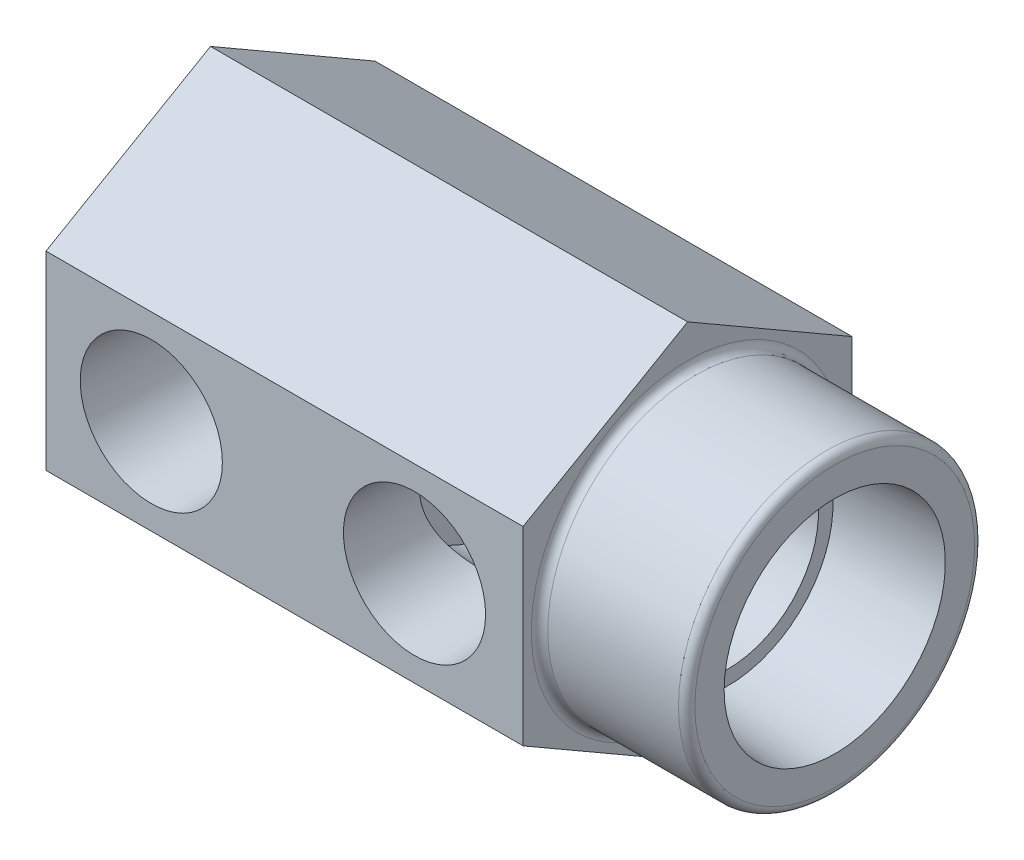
from build123d import *

# Parameters (mm, degrees)
BOSS_EXTRUDE1_DEPTH                  = 46.0375
SKETCH3_R                            = 14.2875
BOSS_EXTRUDE2_DEPTH                  = 14.1986
F_1_4_NPT_TAPPED_HOLE2_AT_2_COUNT    = 2
F_1_4_NPT_TAPPED_HOLE2_AT_2_PITCH    = 25.4
FILLET1_R                            = 0.79375
F_25_64_0_39063_DIAMETER_HOLE1_D     = 9.922002
F_25_64_0_39063_DIAMETER_HOLE1_DEPTH = 50.8
F_25_64_0_39063_DIAMETER_HOLE1_TIP   = 2.980870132
F_7_16_0_4375_DIAMETER_HOLE1_D       = 11.1125
F_7_16_0_4375_DIAMETER_HOLE1_DEPTH   = 45.72
F_7_16_0_4375_DIAMETER_HOLE1_TIP     = 3.338531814


with BuildPart() as part:
    # Sketch2 → Boss-Extrude1 (new body)
    with BuildSketch(Plane(origin=(0, 0, 0), x_dir=(0, 0, -1), z_dir=(1, 0, 0))):
        Polygon((15.875, -9.165435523), (15.875, 9.165435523), (0, 18.330871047), (-15.875, 9.165435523), (-15.875, -9.165435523), (0, -18.330871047), align=None)
    extrude(amount=BOSS_EXTRUDE1_DEPTH)

    # Sketch3 → Boss-Extrude2 (add)
    with BuildSketch(Plane(origin=(46.0375, 0, 0), x_dir=(0, 0, -1), z_dir=(1, 0, 0))):
        with Locations(Location((0, 0, 0), (0, 0, 180))):
            Circle(SKETCH3_R)
    extrude(amount=BOSS_EXTRUDE2_DEPTH)

    # Sketch5 → Cut-Revolve1 (revolve, cut)
    with BuildSketch(Plane(origin=(0, 0, 0), x_dir=(1, 0, 0), z_dir=(0, 1, 0)), mode=Mode.PRIVATE) as cut_revolve1_sk:
        Polygon((49.9364, 8.73125), (27.2161, 8.73125), (27.2161, 0), (60.2361, 0), (60.2361, 10.674384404), (49.9364, 10.1346), align=None)
    revolve(cut_revolve1_sk.sketch.rotate(Axis((-14.001925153, 0, 0), (1, 0, 0)), 180), axis=Axis((-14.001925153, 0, 0), (1, 0, 0)), mode=Mode.SUBTRACT)

    # Sketch6 → 1_4 NPT Tapped Hole1 (revolve, cut)
    with BuildSketch(Plane(origin=(10.16, 0, -15.875), x_dir=(0, 1, 0), z_dir=(1, 0, 0))):
        Polygon((0, 0), (0, 20.411147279), (5.5626, 17.0688), (5.5626, 10.0203), (6.557978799, 10.0203), (6.858, 0), align=None)
    revolve(axis=Axis((10.16, 0, -22.225), (0, 0, 1)), mode=Mode.SUBTRACT)

    # Sketch8 → 1_4 NPT Tapped Hole2 (revolve, cut)
    with BuildSketch(Plane(origin=(10.16, 0, 15.875), x_dir=(0, -1, 0), z_dir=(1, 0, 0))):
        Polygon((0, 0), (0, 16.042347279), (5.5626, 12.7), (5.5626, 10.0203), (6.557978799, 10.0203), (6.858, 0), align=None)
    f_1_4_npt_tapped_hole2 = revolve(axis=Axis((10.16, 0, 22.225), (0, 0, -1)), mode=Mode.SUBTRACT)

    # 1_4 NPT Tapped Hole2 at 2: 1_4 NPT Tapped Hole2 ×2
    with Locations(*[(i * F_1_4_NPT_TAPPED_HOLE2_AT_2_PITCH, 0, 0) for i in range(1, F_1_4_NPT_TAPPED_HOLE2_AT_2_COUNT)]):
        add(f_1_4_npt_tapped_hole2, mode=Mode.SUBTRACT)

    # Fillet1
    fillet1_edges = [part.edges().sort_by_distance(p)[0] for p in [
        (46.0375, 0, -14.2875),
        (60.2361, 0, -14.2875),
    ]]
    fillet(fillet1_edges, radius=FILLET1_R)

    # 25_64 _0.39063_ Diameter Hole1
    with Locations(Plane(origin=(60.2361, 0, 0), x_dir=(0, 0, -1), z_dir=(1, 0, 0))):
        with Locations((0, 0)):
            Hole(F_25_64_0_39063_DIAMETER_HOLE1_D / 2, depth=F_25_64_0_39063_DIAMETER_HOLE1_DEPTH)
            with Locations((0, 0, -(F_25_64_0_39063_DIAMETER_HOLE1_DEPTH + F_25_64_0_39063_DIAMETER_HOLE1_TIP / 2))):  # 118° drill point
                Cone(0, F_25_64_0_39063_DIAMETER_HOLE1_D / 2, F_25_64_0_39063_DIAMETER_HOLE1_TIP, mode=Mode.SUBTRACT)

    # 7_16 _0.4375_ Diameter Hole1
    with Locations(Plane(origin=(60.2361, 0, 0), x_dir=(0, 0, -1), z_dir=(1, 0, 0))):
        with Locations((0, 0)):
            Hole(F_7_16_0_4375_DIAMETER_HOLE1_D / 2, depth=F_7_16_0_4375_DIAMETER_HOLE1_DEPTH)
            with Locations((0, 0, -(F_7_16_0_4375_DIAMETER_HOLE1_DEPTH + F_7_16_0_4375_DIAMETER_HOLE1_TIP / 2))):  # 118° drill point
                Cone(0, F_7_16_0_4375_DIAMETER_HOLE1_D / 2, F_7_16_0_4375_DIAMETER_HOLE1_TIP, mode=Mode.SUBTRACT)


solid = part.part
